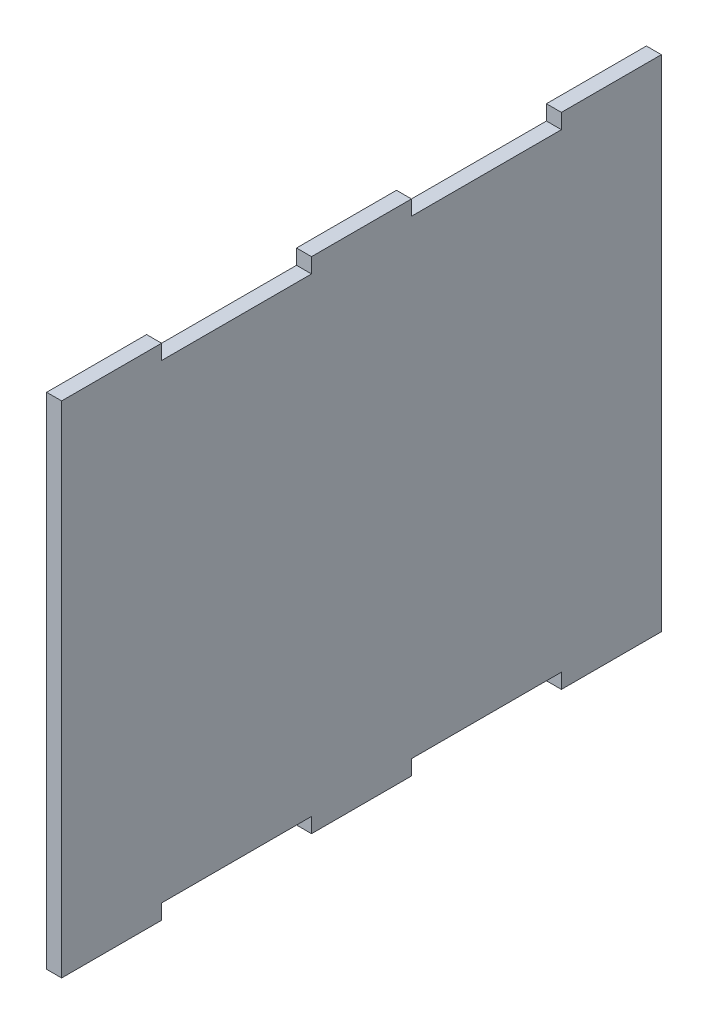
ISO-10303-21;
HEADER;
FILE_DESCRIPTION(('STEP AP214'),'2;1');
FILE_NAME('part.step','',(''),(''),'','','');
FILE_SCHEMA(('AUTOMOTIVE_DESIGN { 1 0 10303 214 1 1 1 1 }'));
ENDSEC;
DATA;
#1=APPLICATION_CONTEXT('core data for automotive mechanical design processes');
#2=APPLICATION_PROTOCOL_DEFINITION('international standard','automotive_design',2000,#1);
#3=PRODUCT_CONTEXT('',#1,'mechanical');
#4=PRODUCT('Part','Part','',(#3));
#5=PRODUCT_RELATED_PRODUCT_CATEGORY('part','',(#4));
#6=PRODUCT_DEFINITION_FORMATION('','',#4);
#7=PRODUCT_DEFINITION_CONTEXT('part definition',#1,'design');
#8=PRODUCT_DEFINITION('design','',#6,#7);
#9=PRODUCT_DEFINITION_SHAPE('','',#8);
#10=(LENGTH_UNIT() NAMED_UNIT(*) SI_UNIT(.MILLI.,.METRE.));
#11=(NAMED_UNIT(*) PLANE_ANGLE_UNIT() SI_UNIT($,.RADIAN.));
#12=(NAMED_UNIT(*) SI_UNIT($,.STERADIAN.) SOLID_ANGLE_UNIT());
#13=UNCERTAINTY_MEASURE_WITH_UNIT(LENGTH_MEASURE(1.E-05),#10,'distance_accuracy_value','');
#14=(GEOMETRIC_REPRESENTATION_CONTEXT(3) GLOBAL_UNCERTAINTY_ASSIGNED_CONTEXT((#13)) GLOBAL_UNIT_ASSIGNED_CONTEXT((#10,
#11,#12)) REPRESENTATION_CONTEXT('',''));
#15=CARTESIAN_POINT('',(0.,0.,0.));
#16=DIRECTION('',(0.,0.,1.));
#17=DIRECTION('',(1.,0.,0.));
#18=AXIS2_PLACEMENT_3D('',#15,#16,#17);
#19=CARTESIAN_POINT('',(3.,26.9737387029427,-55.5352166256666));
#20=DIRECTION('',(0.,-1.,0.));
#21=DIRECTION('',(0.,0.,-1.));
#22=AXIS2_PLACEMENT_3D('',#19,#20,#21);
#23=PLANE('',#22);
#24=DIRECTION('',(0.,0.,1.));
#25=VECTOR('',#24,1.);
#26=CARTESIAN_POINT('',(0.,26.9737387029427,-55.5352166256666));
#27=LINE('',#26,#25);
#28=CARTESIAN_POINT('',(0.,26.9737387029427,-35.5352166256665));
#29=VERTEX_POINT('',#28);
#30=CARTESIAN_POINT('',(0.,26.9737387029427,-5.53521662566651));
#31=VERTEX_POINT('',#30);
#32=EDGE_CURVE('E320',#29,#31,#27,.T.);
#33=ORIENTED_EDGE('',*,*,#32,.T.);
#34=DIRECTION('',(1.,0.,0.));
#35=VECTOR('',#34,1.);
#36=CARTESIAN_POINT('',(0.,26.9737387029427,-5.53521662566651));
#37=LINE('',#36,#35);
#38=CARTESIAN_POINT('',(3.,26.9737387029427,-5.53521662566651));
#39=VERTEX_POINT('',#38);
#40=EDGE_CURVE('E217',#31,#39,#37,.T.);
#41=ORIENTED_EDGE('',*,*,#40,.T.);
#42=DIRECTION('',(0.,0.,1.));
#43=VECTOR('',#42,1.);
#44=CARTESIAN_POINT('',(3.,26.9737387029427,-55.5352166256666));
#45=LINE('',#44,#43);
#46=CARTESIAN_POINT('',(3.,26.9737387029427,-35.5352166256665));
#47=VERTEX_POINT('',#46);
#48=EDGE_CURVE('E311',#47,#39,#45,.T.);
#49=ORIENTED_EDGE('',*,*,#48,.F.);
#50=DIRECTION('',(1.,0.,0.));
#51=VECTOR('',#50,1.);
#52=CARTESIAN_POINT('',(0.,26.9737387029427,-35.5352166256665));
#53=LINE('',#52,#51);
#54=EDGE_CURVE('E238',#29,#47,#53,.T.);
#55=ORIENTED_EDGE('',*,*,#54,.F.);
#56=EDGE_LOOP('',(#33,#41,#49,#55));
#57=FACE_BOUND('',#56,.T.);
#58=ADVANCED_FACE('F32',(#57),#23,.F.);
#59=CARTESIAN_POINT('',(0.,26.9737387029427,14.4647833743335));
#60=VERTEX_POINT('',#59);
#61=CARTESIAN_POINT('',(0.,26.9737387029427,44.4647833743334));
#62=VERTEX_POINT('',#61);
#63=EDGE_CURVE('E54',#60,#62,#27,.T.);
#64=ORIENTED_EDGE('',*,*,#63,.T.);
#65=DIRECTION('',(1.,0.,0.));
#66=VECTOR('',#65,1.);
#67=CARTESIAN_POINT('',(0.,26.9737387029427,44.4647833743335));
#68=LINE('',#67,#66);
#69=CARTESIAN_POINT('',(3.,26.9737387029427,44.4647833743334));
#70=VERTEX_POINT('',#69);
#71=EDGE_CURVE('E49',#62,#70,#68,.T.);
#72=ORIENTED_EDGE('',*,*,#71,.T.);
#73=CARTESIAN_POINT('',(3.,26.9737387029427,14.4647833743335));
#74=VERTEX_POINT('',#73);
#75=EDGE_CURVE('E315',#74,#70,#45,.T.);
#76=ORIENTED_EDGE('',*,*,#75,.F.);
#77=DIRECTION('',(1.,0.,0.));
#78=VECTOR('',#77,1.);
#79=CARTESIAN_POINT('',(0.,26.9737387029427,14.4647833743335));
#80=LINE('',#79,#78);
#81=EDGE_CURVE('E220',#60,#74,#80,.T.);
#82=ORIENTED_EDGE('',*,*,#81,.F.);
#83=EDGE_LOOP('',(#64,#72,#76,#82));
#84=FACE_BOUND('',#83,.T.);
#85=ADVANCED_FACE('F34',(#84),#23,.F.);
#86=CARTESIAN_POINT('',(3.,-67.0262612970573,64.4647833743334));
#87=DIRECTION('',(0.,1.,0.));
#88=DIRECTION('',(0.,0.,1.));
#89=AXIS2_PLACEMENT_3D('',#86,#87,#88);
#90=PLANE('',#89);
#91=DIRECTION('',(0.,0.,-1.));
#92=VECTOR('',#91,1.);
#93=CARTESIAN_POINT('',(0.,-67.0262612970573,64.4647833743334));
#94=LINE('',#93,#92);
#95=CARTESIAN_POINT('',(0.,-67.0262612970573,-5.53521662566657));
#96=VERTEX_POINT('',#95);
#97=CARTESIAN_POINT('',(0.,-67.0262612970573,-35.5352166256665));
#98=VERTEX_POINT('',#97);
#99=EDGE_CURVE('E322',#96,#98,#94,.T.);
#100=ORIENTED_EDGE('',*,*,#99,.T.);
#101=DIRECTION('',(1.,0.,0.));
#102=VECTOR('',#101,1.);
#103=CARTESIAN_POINT('',(0.,-67.0262612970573,-35.5352166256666));
#104=LINE('',#103,#102);
#105=CARTESIAN_POINT('',(3.,-67.0262612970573,-35.5352166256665));
#106=VERTEX_POINT('',#105);
#107=EDGE_CURVE('E253',#98,#106,#104,.T.);
#108=ORIENTED_EDGE('',*,*,#107,.T.);
#109=DIRECTION('',(0.,0.,-1.));
#110=VECTOR('',#109,1.);
#111=CARTESIAN_POINT('',(3.,-67.0262612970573,64.4647833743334));
#112=LINE('',#111,#110);
#113=CARTESIAN_POINT('',(3.,-67.0262612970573,-5.53521662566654));
#114=VERTEX_POINT('',#113);
#115=EDGE_CURVE('E317',#114,#106,#112,.T.);
#116=ORIENTED_EDGE('',*,*,#115,.F.);
#117=DIRECTION('',(1.,0.,0.));
#118=VECTOR('',#117,1.);
#119=CARTESIAN_POINT('',(0.,-67.0262612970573,-5.53521662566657));
#120=LINE('',#119,#118);
#121=EDGE_CURVE('E283',#96,#114,#120,.T.);
#122=ORIENTED_EDGE('',*,*,#121,.F.);
#123=EDGE_LOOP('',(#100,#108,#116,#122));
#124=FACE_BOUND('',#123,.T.);
#125=ADVANCED_FACE('F330',(#124),#90,.F.);
#126=CARTESIAN_POINT('',(0.,-67.0262612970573,44.4647833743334));
#127=VERTEX_POINT('',#126);
#128=CARTESIAN_POINT('',(0.,-67.0262612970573,14.4647833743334));
#129=VERTEX_POINT('',#128);
#130=EDGE_CURVE('E323',#127,#129,#94,.T.);
#131=ORIENTED_EDGE('',*,*,#130,.T.);
#132=DIRECTION('',(1.,0.,0.));
#133=VECTOR('',#132,1.);
#134=CARTESIAN_POINT('',(0.,-67.0262612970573,14.4647833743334));
#135=LINE('',#134,#133);
#136=CARTESIAN_POINT('',(3.,-67.0262612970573,14.4647833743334));
#137=VERTEX_POINT('',#136);
#138=EDGE_CURVE('E275',#129,#137,#135,.T.);
#139=ORIENTED_EDGE('',*,*,#138,.T.);
#140=CARTESIAN_POINT('',(3.,-67.0262612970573,44.4647833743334));
#141=VERTEX_POINT('',#140);
#142=EDGE_CURVE('E41',#141,#137,#112,.T.);
#143=ORIENTED_EDGE('',*,*,#142,.F.);
#144=DIRECTION('',(1.,0.,0.));
#145=VECTOR('',#144,1.);
#146=CARTESIAN_POINT('',(0.,-67.0262612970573,44.4647833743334));
#147=LINE('',#146,#145);
#148=EDGE_CURVE('E304',#127,#141,#147,.T.);
#149=ORIENTED_EDGE('',*,*,#148,.F.);
#150=EDGE_LOOP('',(#131,#139,#143,#149));
#151=FACE_BOUND('',#150,.T.);
#152=ADVANCED_FACE('F355',(#151),#90,.F.);
#153=CARTESIAN_POINT('',(3.,26.9737387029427,64.4647833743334));
#154=DIRECTION('',(0.,0.,-1.));
#155=DIRECTION('',(-1.,0.,0.));
#156=AXIS2_PLACEMENT_3D('',#153,#154,#155);
#157=PLANE('',#156);
#158=DIRECTION('',(0.,-1.,0.));
#159=VECTOR('',#158,1.);
#160=CARTESIAN_POINT('',(0.,26.9737387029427,64.4647833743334));
#161=LINE('',#160,#159);
#162=CARTESIAN_POINT('',(0.,29.9737387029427,64.4647833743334));
#163=VERTEX_POINT('',#162);
#164=CARTESIAN_POINT('',(0.,-70.0262612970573,64.4647833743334));
#165=VERTEX_POINT('',#164);
#166=EDGE_CURVE('E187',#163,#165,#161,.T.);
#167=ORIENTED_EDGE('',*,*,#166,.T.);
#168=DIRECTION('',(1.,0.,0.));
#169=VECTOR('',#168,1.);
#170=CARTESIAN_POINT('',(0.,-70.0262612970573,64.4647833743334));
#171=LINE('',#170,#169);
#172=CARTESIAN_POINT('',(3.,-70.0262612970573,64.4647833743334));
#173=VERTEX_POINT('',#172);
#174=EDGE_CURVE('E299',#165,#173,#171,.T.);
#175=ORIENTED_EDGE('',*,*,#174,.T.);
#176=DIRECTION('',(0.,-1.,0.));
#177=VECTOR('',#176,1.);
#178=CARTESIAN_POINT('',(3.,26.9737387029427,64.4647833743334));
#179=LINE('',#178,#177);
#180=CARTESIAN_POINT('',(3.,29.9737387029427,64.4647833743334));
#181=VERTEX_POINT('',#180);
#182=EDGE_CURVE('E314',#181,#173,#179,.T.);
#183=ORIENTED_EDGE('',*,*,#182,.F.);
#184=DIRECTION('',(1.,0.,0.));
#185=VECTOR('',#184,1.);
#186=CARTESIAN_POINT('',(0.,29.9737387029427,64.4647833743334));
#187=LINE('',#186,#185);
#188=EDGE_CURVE('E179',#163,#181,#187,.T.);
#189=ORIENTED_EDGE('',*,*,#188,.F.);
#190=EDGE_LOOP('',(#167,#175,#183,#189));
#191=FACE_BOUND('',#190,.T.);
#192=ADVANCED_FACE('F365',(#191),#157,.F.);
#193=CARTESIAN_POINT('',(3.,-67.0262612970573,-55.5352166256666));
#194=DIRECTION('',(0.,0.,1.));
#195=DIRECTION('',(0.,-1.,0.));
#196=AXIS2_PLACEMENT_3D('',#193,#194,#195);
#197=PLANE('',#196);
#198=DIRECTION('',(0.,1.,0.));
#199=VECTOR('',#198,1.);
#200=CARTESIAN_POINT('',(0.,-67.0262612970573,-55.5352166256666));
#201=LINE('',#200,#199);
#202=CARTESIAN_POINT('',(0.,-70.0262612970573,-55.5352166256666));
#203=VERTEX_POINT('',#202);
#204=CARTESIAN_POINT('',(0.,29.9737387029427,-55.5352166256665));
#205=VERTEX_POINT('',#204);
#206=EDGE_CURVE('E36',#203,#205,#201,.T.);
#207=ORIENTED_EDGE('',*,*,#206,.T.);
#208=DIRECTION('',(1.,0.,0.));
#209=VECTOR('',#208,1.);
#210=CARTESIAN_POINT('',(0.,29.9737387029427,-55.5352166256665));
#211=LINE('',#210,#209);
#212=CARTESIAN_POINT('',(3.,29.9737387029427,-55.5352166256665));
#213=VERTEX_POINT('',#212);
#214=EDGE_CURVE('E233',#205,#213,#211,.T.);
#215=ORIENTED_EDGE('',*,*,#214,.T.);
#216=DIRECTION('',(0.,1.,0.));
#217=VECTOR('',#216,1.);
#218=CARTESIAN_POINT('',(3.,-67.0262612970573,-55.5352166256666));
#219=LINE('',#218,#217);
#220=CARTESIAN_POINT('',(3.,-70.0262612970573,-55.5352166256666));
#221=VERTEX_POINT('',#220);
#222=EDGE_CURVE('E11',#221,#213,#219,.T.);
#223=ORIENTED_EDGE('',*,*,#222,.F.);
#224=DIRECTION('',(1.,0.,0.));
#225=VECTOR('',#224,1.);
#226=CARTESIAN_POINT('',(0.,-70.0262612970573,-55.5352166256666));
#227=LINE('',#226,#225);
#228=EDGE_CURVE('E258',#203,#221,#227,.T.);
#229=ORIENTED_EDGE('',*,*,#228,.F.);
#230=EDGE_LOOP('',(#207,#215,#223,#229));
#231=FACE_BOUND('',#230,.T.);
#232=ADVANCED_FACE('F389',(#231),#197,.F.);
#233=CARTESIAN_POINT('',(3.,0.,0.));
#234=DIRECTION('',(1.,0.,0.));
#235=DIRECTION('',(0.,0.,-1.));
#236=AXIS2_PLACEMENT_3D('',#233,#234,#235);
#237=PLANE('',#236);
#238=ORIENTED_EDGE('',*,*,#222,.T.);
#239=DIRECTION('',(0.,0.,1.));
#240=VECTOR('',#239,1.);
#241=CARTESIAN_POINT('',(3.,29.9737387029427,-35.5352166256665));
#242=LINE('',#241,#240);
#243=CARTESIAN_POINT('',(3.,29.9737387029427,-35.5352166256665));
#244=VERTEX_POINT('',#243);
#245=EDGE_CURVE('E219',#213,#244,#242,.T.);
#246=ORIENTED_EDGE('',*,*,#245,.T.);
#247=DIRECTION('',(0.,-1.,0.));
#248=VECTOR('',#247,1.);
#249=CARTESIAN_POINT('',(3.,26.9737387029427,-35.5352166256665));
#250=LINE('',#249,#248);
#251=EDGE_CURVE('E230',#244,#47,#250,.T.);
#252=ORIENTED_EDGE('',*,*,#251,.T.);
#253=ORIENTED_EDGE('',*,*,#48,.T.);
#254=DIRECTION('',(0.,1.,0.));
#255=VECTOR('',#254,1.);
#256=CARTESIAN_POINT('',(3.,29.9737387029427,-5.53521662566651));
#257=LINE('',#256,#255);
#258=CARTESIAN_POINT('',(3.,29.9737387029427,-5.53521662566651));
#259=VERTEX_POINT('',#258);
#260=EDGE_CURVE('E197',#39,#259,#257,.T.);
#261=ORIENTED_EDGE('',*,*,#260,.T.);
#262=DIRECTION('',(0.,0.,1.));
#263=VECTOR('',#262,1.);
#264=CARTESIAN_POINT('',(3.,29.9737387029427,14.4647833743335));
#265=LINE('',#264,#263);
#266=CARTESIAN_POINT('',(3.,29.9737387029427,14.4647833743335));
#267=VERTEX_POINT('',#266);
#268=EDGE_CURVE('E212',#259,#267,#265,.T.);
#269=ORIENTED_EDGE('',*,*,#268,.T.);
#270=DIRECTION('',(0.,-1.,0.));
#271=VECTOR('',#270,1.);
#272=CARTESIAN_POINT('',(3.,26.9737387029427,14.4647833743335));
#273=LINE('',#272,#271);
#274=EDGE_CURVE('E203',#267,#74,#273,.T.);
#275=ORIENTED_EDGE('',*,*,#274,.T.);
#276=ORIENTED_EDGE('',*,*,#75,.T.);
#277=DIRECTION('',(0.,1.,0.));
#278=VECTOR('',#277,1.);
#279=CARTESIAN_POINT('',(3.,29.9737387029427,44.4647833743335));
#280=LINE('',#279,#278);
#281=CARTESIAN_POINT('',(3.,29.9737387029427,44.4647833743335));
#282=VERTEX_POINT('',#281);
#283=EDGE_CURVE('E192',#70,#282,#280,.T.);
#284=ORIENTED_EDGE('',*,*,#283,.T.);
#285=DIRECTION('',(0.,0.,1.));
#286=VECTOR('',#285,1.);
#287=CARTESIAN_POINT('',(3.,29.9737387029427,64.4647833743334));
#288=LINE('',#287,#286);
#289=EDGE_CURVE('E174',#282,#181,#288,.T.);
#290=ORIENTED_EDGE('',*,*,#289,.T.);
#291=ORIENTED_EDGE('',*,*,#182,.T.);
#292=DIRECTION('',(0.,0.,-1.));
#293=VECTOR('',#292,1.);
#294=CARTESIAN_POINT('',(3.,-70.0262612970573,64.4647833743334));
#295=LINE('',#294,#293);
#296=CARTESIAN_POINT('',(3.,-70.0262612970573,44.4647833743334));
#297=VERTEX_POINT('',#296);
#298=EDGE_CURVE('E286',#173,#297,#295,.T.);
#299=ORIENTED_EDGE('',*,*,#298,.T.);
#300=DIRECTION('',(0.,1.,0.));
#301=VECTOR('',#300,1.);
#302=CARTESIAN_POINT('',(3.,-70.0262612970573,44.4647833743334));
#303=LINE('',#302,#301);
#304=EDGE_CURVE('E296',#297,#141,#303,.T.);
#305=ORIENTED_EDGE('',*,*,#304,.T.);
#306=ORIENTED_EDGE('',*,*,#142,.T.);
#307=DIRECTION('',(0.,-1.,0.));
#308=VECTOR('',#307,1.);
#309=CARTESIAN_POINT('',(3.,-67.0262612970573,14.4647833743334));
#310=LINE('',#309,#308);
#311=CARTESIAN_POINT('',(3.,-70.0262612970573,14.4647833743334));
#312=VERTEX_POINT('',#311);
#313=EDGE_CURVE('E261',#137,#312,#310,.T.);
#314=ORIENTED_EDGE('',*,*,#313,.T.);
#315=DIRECTION('',(0.,0.,-1.));
#316=VECTOR('',#315,1.);
#317=CARTESIAN_POINT('',(3.,-70.0262612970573,14.4647833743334));
#318=LINE('',#317,#316);
#319=CARTESIAN_POINT('',(3.,-70.0262612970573,-5.53521662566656));
#320=VERTEX_POINT('',#319);
#321=EDGE_CURVE('E278',#312,#320,#318,.T.);
#322=ORIENTED_EDGE('',*,*,#321,.T.);
#323=DIRECTION('',(0.,1.,0.));
#324=VECTOR('',#323,1.);
#325=CARTESIAN_POINT('',(3.,-70.0262612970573,-5.53521662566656));
#326=LINE('',#325,#324);
#327=EDGE_CURVE('E269',#320,#114,#326,.T.);
#328=ORIENTED_EDGE('',*,*,#327,.T.);
#329=ORIENTED_EDGE('',*,*,#115,.T.);
#330=DIRECTION('',(0.,-1.,0.));
#331=VECTOR('',#330,1.);
#332=CARTESIAN_POINT('',(3.,-67.0262612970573,-35.5352166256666));
#333=LINE('',#332,#331);
#334=CARTESIAN_POINT('',(3.,-70.0262612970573,-35.5352166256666));
#335=VERTEX_POINT('',#334);
#336=EDGE_CURVE('E241',#106,#335,#333,.T.);
#337=ORIENTED_EDGE('',*,*,#336,.T.);
#338=DIRECTION('',(0.,0.,-1.));
#339=VECTOR('',#338,1.);
#340=CARTESIAN_POINT('',(3.,-70.0262612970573,-35.5352166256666));
#341=LINE('',#340,#339);
#342=EDGE_CURVE('E250',#335,#221,#341,.T.);
#343=ORIENTED_EDGE('',*,*,#342,.T.);
#344=EDGE_LOOP('',(#238,#246,#252,#253,#261,#269,#275,#276,#284,#290,#291,#299,#305,#306,#314,
#322,#328,#329,#337,#343));
#345=FACE_BOUND('',#344,.T.);
#346=ADVANCED_FACE('F344',(#345),#237,.T.);
#347=CARTESIAN_POINT('',(0.,0.,0.));
#348=DIRECTION('',(1.,0.,0.));
#349=DIRECTION('',(0.,0.,-1.));
#350=AXIS2_PLACEMENT_3D('',#347,#348,#349);
#351=PLANE('',#350);
#352=ORIENTED_EDGE('',*,*,#32,.F.);
#353=DIRECTION('',(0.,-1.,0.));
#354=VECTOR('',#353,1.);
#355=CARTESIAN_POINT('',(0.,26.9737387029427,-35.5352166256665));
#356=LINE('',#355,#354);
#357=CARTESIAN_POINT('',(0.,29.9737387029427,-35.5352166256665));
#358=VERTEX_POINT('',#357);
#359=EDGE_CURVE('E229',#358,#29,#356,.T.);
#360=ORIENTED_EDGE('',*,*,#359,.F.);
#361=DIRECTION('',(0.,0.,1.));
#362=VECTOR('',#361,1.);
#363=CARTESIAN_POINT('',(0.,29.9737387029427,-35.5352166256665));
#364=LINE('',#363,#362);
#365=EDGE_CURVE('E226',#205,#358,#364,.T.);
#366=ORIENTED_EDGE('',*,*,#365,.F.);
#367=ORIENTED_EDGE('',*,*,#206,.F.);
#368=DIRECTION('',(0.,0.,-1.));
#369=VECTOR('',#368,1.);
#370=CARTESIAN_POINT('',(0.,-70.0262612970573,-35.5352166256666));
#371=LINE('',#370,#369);
#372=CARTESIAN_POINT('',(0.,-70.0262612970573,-35.5352166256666));
#373=VERTEX_POINT('',#372);
#374=EDGE_CURVE('E249',#373,#203,#371,.T.);
#375=ORIENTED_EDGE('',*,*,#374,.F.);
#376=DIRECTION('',(0.,-1.,0.));
#377=VECTOR('',#376,1.);
#378=CARTESIAN_POINT('',(0.,-67.0262612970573,-35.5352166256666));
#379=LINE('',#378,#377);
#380=EDGE_CURVE('E246',#98,#373,#379,.T.);
#381=ORIENTED_EDGE('',*,*,#380,.F.);
#382=ORIENTED_EDGE('',*,*,#99,.F.);
#383=DIRECTION('',(0.,1.,0.));
#384=VECTOR('',#383,1.);
#385=CARTESIAN_POINT('',(0.,-70.0262612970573,-5.53521662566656));
#386=LINE('',#385,#384);
#387=CARTESIAN_POINT('',(0.,-70.0262612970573,-5.53521662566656));
#388=VERTEX_POINT('',#387);
#389=EDGE_CURVE('E272',#388,#96,#386,.T.);
#390=ORIENTED_EDGE('',*,*,#389,.F.);
#391=DIRECTION('',(0.,0.,-1.));
#392=VECTOR('',#391,1.);
#393=CARTESIAN_POINT('',(0.,-70.0262612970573,14.4647833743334));
#394=LINE('',#393,#392);
#395=CARTESIAN_POINT('',(0.,-70.0262612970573,14.4647833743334));
#396=VERTEX_POINT('',#395);
#397=EDGE_CURVE('E268',#396,#388,#394,.T.);
#398=ORIENTED_EDGE('',*,*,#397,.F.);
#399=DIRECTION('',(0.,-1.,0.));
#400=VECTOR('',#399,1.);
#401=CARTESIAN_POINT('',(0.,-67.0262612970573,14.4647833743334));
#402=LINE('',#401,#400);
#403=EDGE_CURVE('E265',#129,#396,#402,.T.);
#404=ORIENTED_EDGE('',*,*,#403,.F.);
#405=ORIENTED_EDGE('',*,*,#130,.F.);
#406=DIRECTION('',(0.,1.,0.));
#407=VECTOR('',#406,1.);
#408=CARTESIAN_POINT('',(0.,-70.0262612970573,44.4647833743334));
#409=LINE('',#408,#407);
#410=CARTESIAN_POINT('',(0.,-70.0262612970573,44.4647833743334));
#411=VERTEX_POINT('',#410);
#412=EDGE_CURVE('E295',#411,#127,#409,.T.);
#413=ORIENTED_EDGE('',*,*,#412,.F.);
#414=DIRECTION('',(0.,0.,-1.));
#415=VECTOR('',#414,1.);
#416=CARTESIAN_POINT('',(0.,-70.0262612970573,64.4647833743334));
#417=LINE('',#416,#415);
#418=EDGE_CURVE('E292',#165,#411,#417,.T.);
#419=ORIENTED_EDGE('',*,*,#418,.F.);
#420=ORIENTED_EDGE('',*,*,#166,.F.);
#421=DIRECTION('',(0.,0.,1.));
#422=VECTOR('',#421,1.);
#423=CARTESIAN_POINT('',(0.,29.9737387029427,64.4647833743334));
#424=LINE('',#423,#422);
#425=CARTESIAN_POINT('',(0.,29.9737387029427,44.4647833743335));
#426=VERTEX_POINT('',#425);
#427=EDGE_CURVE('E172',#426,#163,#424,.T.);
#428=ORIENTED_EDGE('',*,*,#427,.F.);
#429=DIRECTION('',(0.,1.,0.));
#430=VECTOR('',#429,1.);
#431=CARTESIAN_POINT('',(0.,29.9737387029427,44.4647833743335));
#432=LINE('',#431,#430);
#433=EDGE_CURVE('E185',#62,#426,#432,.T.);
#434=ORIENTED_EDGE('',*,*,#433,.F.);
#435=ORIENTED_EDGE('',*,*,#63,.F.);
#436=DIRECTION('',(0.,-1.,0.));
#437=VECTOR('',#436,1.);
#438=CARTESIAN_POINT('',(0.,26.9737387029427,14.4647833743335));
#439=LINE('',#438,#437);
#440=CARTESIAN_POINT('',(0.,29.9737387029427,14.4647833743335));
#441=VERTEX_POINT('',#440);
#442=EDGE_CURVE('E206',#441,#60,#439,.T.);
#443=ORIENTED_EDGE('',*,*,#442,.F.);
#444=DIRECTION('',(0.,0.,1.));
#445=VECTOR('',#444,1.);
#446=CARTESIAN_POINT('',(0.,29.9737387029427,14.4647833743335));
#447=LINE('',#446,#445);
#448=CARTESIAN_POINT('',(0.,29.9737387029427,-5.53521662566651));
#449=VERTEX_POINT('',#448);
#450=EDGE_CURVE('E202',#449,#441,#447,.T.);
#451=ORIENTED_EDGE('',*,*,#450,.F.);
#452=DIRECTION('',(0.,1.,0.));
#453=VECTOR('',#452,1.);
#454=CARTESIAN_POINT('',(0.,29.9737387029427,-5.53521662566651));
#455=LINE('',#454,#453);
#456=EDGE_CURVE('E199',#31,#449,#455,.T.);
#457=ORIENTED_EDGE('',*,*,#456,.F.);
#458=EDGE_LOOP('',(#352,#360,#366,#367,#375,#381,#382,#390,#398,#404,#405,#413,#419,#420,#428,
#434,#435,#443,#451,#457));
#459=FACE_BOUND('',#458,.T.);
#460=ADVANCED_FACE('F184',(#459),#351,.F.);
#461=CARTESIAN_POINT('',(0.,-70.0262612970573,44.4647833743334));
#462=DIRECTION('',(0.,0.,-1.));
#463=DIRECTION('',(-1.,0.,0.));
#464=AXIS2_PLACEMENT_3D('',#461,#462,#463);
#465=PLANE('',#464);
#466=ORIENTED_EDGE('',*,*,#304,.F.);
#467=DIRECTION('',(1.,0.,0.));
#468=VECTOR('',#467,1.);
#469=CARTESIAN_POINT('',(0.,-70.0262612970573,44.4647833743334));
#470=LINE('',#469,#468);
#471=EDGE_CURVE('E307',#411,#297,#470,.T.);
#472=ORIENTED_EDGE('',*,*,#471,.F.);
#473=ORIENTED_EDGE('',*,*,#412,.T.);
#474=ORIENTED_EDGE('',*,*,#148,.T.);
#475=EDGE_LOOP('',(#466,#472,#473,#474));
#476=FACE_BOUND('',#475,.T.);
#477=ADVANCED_FACE('F359',(#476),#465,.T.);
#478=CARTESIAN_POINT('',(0.,-70.0262612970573,64.4647833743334));
#479=DIRECTION('',(0.,-1.,0.));
#480=DIRECTION('',(0.,0.,-1.));
#481=AXIS2_PLACEMENT_3D('',#478,#479,#480);
#482=PLANE('',#481);
#483=ORIENTED_EDGE('',*,*,#298,.F.);
#484=ORIENTED_EDGE('',*,*,#174,.F.);
#485=ORIENTED_EDGE('',*,*,#418,.T.);
#486=ORIENTED_EDGE('',*,*,#471,.T.);
#487=EDGE_LOOP('',(#483,#484,#485,#486));
#488=FACE_BOUND('',#487,.T.);
#489=ADVANCED_FACE('F363',(#488),#482,.T.);
#490=CARTESIAN_POINT('',(0.,-70.0262612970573,-5.53521662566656));
#491=DIRECTION('',(0.,0.,-1.));
#492=DIRECTION('',(0.,1.,0.));
#493=AXIS2_PLACEMENT_3D('',#490,#491,#492);
#494=PLANE('',#493);
#495=ORIENTED_EDGE('',*,*,#327,.F.);
#496=DIRECTION('',(1.,0.,0.));
#497=VECTOR('',#496,1.);
#498=CARTESIAN_POINT('',(0.,-70.0262612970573,-5.53521662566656));
#499=LINE('',#498,#497);
#500=EDGE_CURVE('E287',#388,#320,#499,.T.);
#501=ORIENTED_EDGE('',*,*,#500,.F.);
#502=ORIENTED_EDGE('',*,*,#389,.T.);
#503=ORIENTED_EDGE('',*,*,#121,.T.);
#504=EDGE_LOOP('',(#495,#501,#502,#503));
#505=FACE_BOUND('',#504,.T.);
#506=ADVANCED_FACE('F347',(#505),#494,.T.);
#507=CARTESIAN_POINT('',(0.,-70.0262612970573,14.4647833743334));
#508=DIRECTION('',(0.,-1.,0.));
#509=DIRECTION('',(0.,0.,-1.));
#510=AXIS2_PLACEMENT_3D('',#507,#508,#509);
#511=PLANE('',#510);
#512=ORIENTED_EDGE('',*,*,#321,.F.);
#513=DIRECTION('',(1.,0.,0.));
#514=VECTOR('',#513,1.);
#515=CARTESIAN_POINT('',(0.,-70.0262612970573,14.4647833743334));
#516=LINE('',#515,#514);
#517=EDGE_CURVE('E289',#396,#312,#516,.T.);
#518=ORIENTED_EDGE('',*,*,#517,.F.);
#519=ORIENTED_EDGE('',*,*,#397,.T.);
#520=ORIENTED_EDGE('',*,*,#500,.T.);
#521=EDGE_LOOP('',(#512,#518,#519,#520));
#522=FACE_BOUND('',#521,.T.);
#523=ADVANCED_FACE('F421',(#522),#511,.T.);
#524=CARTESIAN_POINT('',(0.,-67.0262612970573,14.4647833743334));
#525=DIRECTION('',(0.,0.,1.));
#526=DIRECTION('',(0.,-1.,0.));
#527=AXIS2_PLACEMENT_3D('',#524,#525,#526);
#528=PLANE('',#527);
#529=ORIENTED_EDGE('',*,*,#313,.F.);
#530=ORIENTED_EDGE('',*,*,#138,.F.);
#531=ORIENTED_EDGE('',*,*,#403,.T.);
#532=ORIENTED_EDGE('',*,*,#517,.T.);
#533=EDGE_LOOP('',(#529,#530,#531,#532));
#534=FACE_BOUND('',#533,.T.);
#535=ADVANCED_FACE('F353',(#534),#528,.T.);
#536=CARTESIAN_POINT('',(0.,-70.0262612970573,-35.5352166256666));
#537=DIRECTION('',(0.,-1.,0.));
#538=DIRECTION('',(0.,0.,-1.));
#539=AXIS2_PLACEMENT_3D('',#536,#537,#538);
#540=PLANE('',#539);
#541=ORIENTED_EDGE('',*,*,#342,.F.);
#542=DIRECTION('',(1.,0.,0.));
#543=VECTOR('',#542,1.);
#544=CARTESIAN_POINT('',(0.,-70.0262612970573,-35.5352166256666));
#545=LINE('',#544,#543);
#546=EDGE_CURVE('E262',#373,#335,#545,.T.);
#547=ORIENTED_EDGE('',*,*,#546,.F.);
#548=ORIENTED_EDGE('',*,*,#374,.T.);
#549=ORIENTED_EDGE('',*,*,#228,.T.);
#550=EDGE_LOOP('',(#541,#547,#548,#549));
#551=FACE_BOUND('',#550,.T.);
#552=ADVANCED_FACE('F342',(#551),#540,.T.);
#553=CARTESIAN_POINT('',(0.,-67.0262612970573,-35.5352166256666));
#554=DIRECTION('',(0.,0.,1.));
#555=DIRECTION('',(0.,-1.,0.));
#556=AXIS2_PLACEMENT_3D('',#553,#554,#555);
#557=PLANE('',#556);
#558=ORIENTED_EDGE('',*,*,#336,.F.);
#559=ORIENTED_EDGE('',*,*,#107,.F.);
#560=ORIENTED_EDGE('',*,*,#380,.T.);
#561=ORIENTED_EDGE('',*,*,#546,.T.);
#562=EDGE_LOOP('',(#558,#559,#560,#561));
#563=FACE_BOUND('',#562,.T.);
#564=ADVANCED_FACE('F336',(#563),#557,.T.);
#565=CARTESIAN_POINT('',(0.,26.9737387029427,-35.5352166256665));
#566=DIRECTION('',(0.,0.,1.));
#567=DIRECTION('',(0.,-1.,0.));
#568=AXIS2_PLACEMENT_3D('',#565,#566,#567);
#569=PLANE('',#568);
#570=ORIENTED_EDGE('',*,*,#251,.F.);
#571=DIRECTION('',(1.,0.,0.));
#572=VECTOR('',#571,1.);
#573=CARTESIAN_POINT('',(0.,29.9737387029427,-35.5352166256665));
#574=LINE('',#573,#572);
#575=EDGE_CURVE('E242',#358,#244,#574,.T.);
#576=ORIENTED_EDGE('',*,*,#575,.F.);
#577=ORIENTED_EDGE('',*,*,#359,.T.);
#578=ORIENTED_EDGE('',*,*,#54,.T.);
#579=EDGE_LOOP('',(#570,#576,#577,#578));
#580=FACE_BOUND('',#579,.T.);
#581=ADVANCED_FACE('F383',(#580),#569,.T.);
#582=CARTESIAN_POINT('',(0.,29.9737387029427,-35.5352166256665));
#583=DIRECTION('',(0.,1.,0.));
#584=DIRECTION('',(0.,0.,1.));
#585=AXIS2_PLACEMENT_3D('',#582,#583,#584);
#586=PLANE('',#585);
#587=ORIENTED_EDGE('',*,*,#245,.F.);
#588=ORIENTED_EDGE('',*,*,#214,.F.);
#589=ORIENTED_EDGE('',*,*,#365,.T.);
#590=ORIENTED_EDGE('',*,*,#575,.T.);
#591=EDGE_LOOP('',(#587,#588,#589,#590));
#592=FACE_BOUND('',#591,.T.);
#593=ADVANCED_FACE('F386',(#592),#586,.T.);
#594=CARTESIAN_POINT('',(0.,29.9737387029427,-5.53521662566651));
#595=DIRECTION('',(0.,0.,-1.));
#596=DIRECTION('',(0.,1.,0.));
#597=AXIS2_PLACEMENT_3D('',#594,#595,#596);
#598=PLANE('',#597);
#599=ORIENTED_EDGE('',*,*,#260,.F.);
#600=ORIENTED_EDGE('',*,*,#40,.F.);
#601=ORIENTED_EDGE('',*,*,#456,.T.);
#602=DIRECTION('',(1.,0.,0.));
#603=VECTOR('',#602,1.);
#604=CARTESIAN_POINT('',(0.,29.9737387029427,-5.53521662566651));
#605=LINE('',#604,#603);
#606=EDGE_CURVE('E209',#449,#259,#605,.T.);
#607=ORIENTED_EDGE('',*,*,#606,.T.);
#608=EDGE_LOOP('',(#599,#600,#601,#607));
#609=FACE_BOUND('',#608,.T.);
#610=ADVANCED_FACE('F377',(#609),#598,.T.);
#611=CARTESIAN_POINT('',(0.,26.9737387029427,14.4647833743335));
#612=DIRECTION('',(0.,0.,1.));
#613=DIRECTION('',(0.,-1.,0.));
#614=AXIS2_PLACEMENT_3D('',#611,#612,#613);
#615=PLANE('',#614);
#616=ORIENTED_EDGE('',*,*,#274,.F.);
#617=DIRECTION('',(1.,0.,0.));
#618=VECTOR('',#617,1.);
#619=CARTESIAN_POINT('',(0.,29.9737387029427,14.4647833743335));
#620=LINE('',#619,#618);
#621=EDGE_CURVE('E223',#441,#267,#620,.T.);
#622=ORIENTED_EDGE('',*,*,#621,.F.);
#623=ORIENTED_EDGE('',*,*,#442,.T.);
#624=ORIENTED_EDGE('',*,*,#81,.T.);
#625=EDGE_LOOP('',(#616,#622,#623,#624));
#626=FACE_BOUND('',#625,.T.);
#627=ADVANCED_FACE('F368',(#626),#615,.T.);
#628=CARTESIAN_POINT('',(0.,29.9737387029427,14.4647833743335));
#629=DIRECTION('',(0.,1.,0.));
#630=DIRECTION('',(0.,0.,1.));
#631=AXIS2_PLACEMENT_3D('',#628,#629,#630);
#632=PLANE('',#631);
#633=ORIENTED_EDGE('',*,*,#268,.F.);
#634=ORIENTED_EDGE('',*,*,#606,.F.);
#635=ORIENTED_EDGE('',*,*,#450,.T.);
#636=ORIENTED_EDGE('',*,*,#621,.T.);
#637=EDGE_LOOP('',(#633,#634,#635,#636));
#638=FACE_BOUND('',#637,.T.);
#639=ADVANCED_FACE('F374',(#638),#632,.T.);
#640=CARTESIAN_POINT('',(0.,29.9737387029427,44.4647833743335));
#641=DIRECTION('',(0.,0.,-1.));
#642=DIRECTION('',(-1.,0.,0.));
#643=AXIS2_PLACEMENT_3D('',#640,#641,#642);
#644=PLANE('',#643);
#645=ORIENTED_EDGE('',*,*,#283,.F.);
#646=ORIENTED_EDGE('',*,*,#71,.F.);
#647=ORIENTED_EDGE('',*,*,#433,.T.);
#648=DIRECTION('',(1.,0.,0.));
#649=VECTOR('',#648,1.);
#650=CARTESIAN_POINT('',(0.,29.9737387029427,44.4647833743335));
#651=LINE('',#650,#649);
#652=EDGE_CURVE('E168',#426,#282,#651,.T.);
#653=ORIENTED_EDGE('',*,*,#652,.T.);
#654=EDGE_LOOP('',(#645,#646,#647,#653));
#655=FACE_BOUND('',#654,.T.);
#656=ADVANCED_FACE('F190',(#655),#644,.T.);
#657=CARTESIAN_POINT('',(0.,29.9737387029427,64.4647833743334));
#658=DIRECTION('',(0.,1.,0.));
#659=DIRECTION('',(0.,0.,1.));
#660=AXIS2_PLACEMENT_3D('',#657,#658,#659);
#661=PLANE('',#660);
#662=ORIENTED_EDGE('',*,*,#289,.F.);
#663=ORIENTED_EDGE('',*,*,#652,.F.);
#664=ORIENTED_EDGE('',*,*,#427,.T.);
#665=ORIENTED_EDGE('',*,*,#188,.T.);
#666=EDGE_LOOP('',(#662,#663,#664,#665));
#667=FACE_BOUND('',#666,.T.);
#668=ADVANCED_FACE('F170',(#667),#661,.T.);
#669=CLOSED_SHELL('',(#58,#85,#125,#152,#192,#232,#346,#460,#477,#489,#506,#523,#535,#552,#564,
#581,#593,#610,#627,#639,#656,#668));
#670=MANIFOLD_SOLID_BREP('B2',#669);
#671=ADVANCED_BREP_SHAPE_REPRESENTATION('',(#18,#670),#14);
#672=SHAPE_DEFINITION_REPRESENTATION(#9,#671);
ENDSEC;
END-ISO-10303-21;
